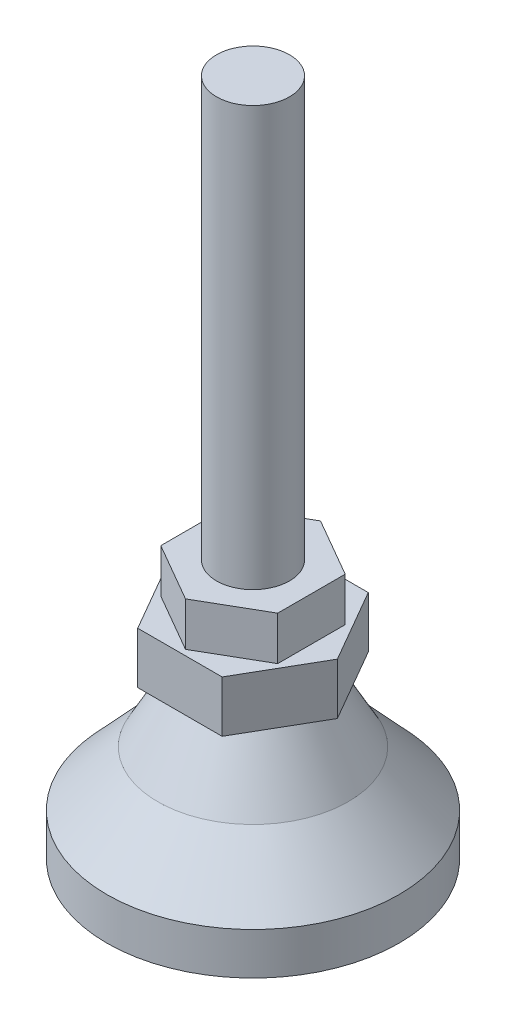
from build123d import *

# Parameters (mm, degrees)
EXTRUDE2_DEPTH = 5.588
EXTRUDE4_DEPTH = 4.7498
SKETCH6_R      = 3.9624
EXTRUDE3_DEPTH = 45.5422


with BuildPart() as part:
    # Sketch4 → Revolve1 (revolve)
    with BuildSketch(Plane.XY, mode=Mode.PRIVATE) as revolve1_sk:
        Polygon((0, 0), (15.875, 0), (15.875, 4.572), (10.3505, 10.541), (6.35, 17.78), (0, 17.78), align=None)
    revolve(revolve1_sk.sketch.rotate(Axis((0, 0, 0), (0, 1, 0)), 90), axis=Axis((0, 0, 0), (0, 1, 0)))

    # Sketch5 → Extrude2 (add)
    with BuildSketch(Plane(origin=(0, 17.78, 0), x_dir=(-1, 0, 0), z_dir=(0, 1, 0))):
        Polygon((4.582717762, 7.9375), (-4.582717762, 7.9375), (-9.165435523, 0), (-4.582717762, -7.9375), (4.582717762, -7.9375), (9.165435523, 0), align=None)
    extrude(amount=EXTRUDE2_DEPTH)

    # Sketch7 → Extrude4 (add)
    with BuildSketch(Plane(origin=(0, 23.368, 0), x_dir=(-1, 0, 0), z_dir=(0, 1, 0))):
        Polygon((-6.35, 3.666174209), (-6.35, -3.666174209), (0, -7.332348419), (6.35, -3.666174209), (6.35, 3.666174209), (0, 7.332348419), align=None)
    extrude(amount=EXTRUDE4_DEPTH)

    # Sketch6 → Extrude3 (add)
    with BuildSketch(Plane(origin=(0, 28.1178, 0), x_dir=(-1, 0, 0), z_dir=(0, 1, 0))):
        with Locations(Location((0, 0, 0), (0, 0, 90))):
            Circle(SKETCH6_R)
    extrude(amount=EXTRUDE3_DEPTH)


solid = part.part
